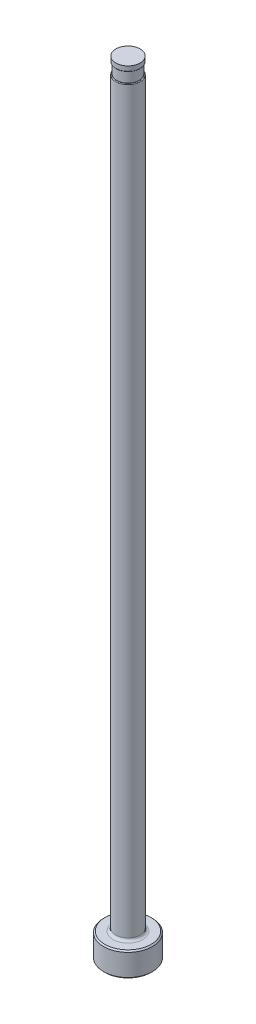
ISO-10303-21;
HEADER;
FILE_DESCRIPTION(('STEP AP214'),'2;1');
FILE_NAME('part.step','',(''),(''),'','','');
FILE_SCHEMA(('AUTOMOTIVE_DESIGN { 1 0 10303 214 1 1 1 1 }'));
ENDSEC;
DATA;
#1=APPLICATION_CONTEXT('core data for automotive mechanical design processes');
#2=APPLICATION_PROTOCOL_DEFINITION('international standard','automotive_design',2000,#1);
#3=PRODUCT_CONTEXT('',#1,'mechanical');
#4=PRODUCT('Part','Part','',(#3));
#5=PRODUCT_RELATED_PRODUCT_CATEGORY('part','',(#4));
#6=PRODUCT_DEFINITION_FORMATION('','',#4);
#7=PRODUCT_DEFINITION_CONTEXT('part definition',#1,'design');
#8=PRODUCT_DEFINITION('design','',#6,#7);
#9=PRODUCT_DEFINITION_SHAPE('','',#8);
#10=(LENGTH_UNIT() NAMED_UNIT(*) SI_UNIT(.MILLI.,.METRE.));
#11=(NAMED_UNIT(*) PLANE_ANGLE_UNIT() SI_UNIT($,.RADIAN.));
#12=(NAMED_UNIT(*) SI_UNIT($,.STERADIAN.) SOLID_ANGLE_UNIT());
#13=UNCERTAINTY_MEASURE_WITH_UNIT(LENGTH_MEASURE(1.E-05),#10,'distance_accuracy_value','');
#14=(GEOMETRIC_REPRESENTATION_CONTEXT(3) GLOBAL_UNCERTAINTY_ASSIGNED_CONTEXT((#13)) GLOBAL_UNIT_ASSIGNED_CONTEXT((#10,
#11,#12)) REPRESENTATION_CONTEXT('',''));
#15=CARTESIAN_POINT('',(0.,0.,0.));
#16=DIRECTION('',(0.,0.,1.));
#17=DIRECTION('',(1.,0.,0.));
#18=AXIS2_PLACEMENT_3D('',#15,#16,#17);
#19=CARTESIAN_POINT('',(-2.38124999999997,151.384,0.));
#20=DIRECTION('',(0.,1.,0.));
#21=DIRECTION('',(0.,0.,1.));
#22=AXIS2_PLACEMENT_3D('',#19,#20,#21);
#23=PLANE('',#22);
#24=CARTESIAN_POINT('',(0.,151.384,0.));
#25=DIRECTION('',(0.,1.,0.));
#26=DIRECTION('',(0.,0.,1.));
#27=AXIS2_PLACEMENT_3D('',#24,#25,#26);
#28=CIRCLE('',#27,2.24916999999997);
#29=CARTESIAN_POINT('',(0.,151.384,2.24916999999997));
#30=VERTEX_POINT('',#29);
#31=EDGE_CURVE('E11',#30,#30,#28,.F.);
#32=ORIENTED_EDGE('',*,*,#31,.T.);
#33=EDGE_LOOP('',(#32));
#34=FACE_BOUND('',#33,.T.);
#35=CARTESIAN_POINT('',(0.,151.384,0.));
#36=DIRECTION('',(0.,1.,0.));
#37=DIRECTION('',(0.,0.,1.));
#38=AXIS2_PLACEMENT_3D('',#35,#36,#37);
#39=CIRCLE('',#38,2.17804999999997);
#40=CARTESIAN_POINT('',(0.,151.384,2.17804999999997));
#41=VERTEX_POINT('',#40);
#42=EDGE_CURVE('E78',#41,#41,#39,.T.);
#43=ORIENTED_EDGE('',*,*,#42,.T.);
#44=EDGE_LOOP('',(#43));
#45=FACE_BOUND('',#44,.T.);
#46=ADVANCED_FACE('F36',(#34,#45),#23,.F.);
#47=CARTESIAN_POINT('',(0.,259.958771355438,0.));
#48=DIRECTION('',(0.,1.,0.));
#49=DIRECTION('',(0.,0.,1.));
#50=AXIS2_PLACEMENT_3D('',#47,#48,#49);
#51=CYLINDRICAL_SURFACE('',#50,2.38124999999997);
#52=DIRECTION('',(0.,1.,0.));
#53=VECTOR('',#52,1.);
#54=CARTESIAN_POINT('',(-2.17804999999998,259.958771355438,-0.962522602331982));
#55=LINE('',#54,#53);
#56=CARTESIAN_POINT('',(-2.17804999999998,149.225,-0.962522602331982));
#57=VERTEX_POINT('',#56);
#58=CARTESIAN_POINT('',(-2.17804999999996,86.868,-0.962522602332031));
#59=VERTEX_POINT('',#58);
#60=EDGE_CURVE('E73',#57,#59,#55,.F.);
#61=ORIENTED_EDGE('',*,*,#60,.F.);
#62=CARTESIAN_POINT('',(0.,149.225,0.));
#63=DIRECTION('',(0.,-1.,0.));
#64=DIRECTION('',(0.,0.,-1.));
#65=AXIS2_PLACEMENT_3D('',#62,#63,#64);
#66=CIRCLE('',#65,2.38124999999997);
#67=CARTESIAN_POINT('',(-2.17804999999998,149.225,0.962522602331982));
#68=VERTEX_POINT('',#67);
#69=EDGE_CURVE('E51',#57,#68,#66,.T.);
#70=ORIENTED_EDGE('',*,*,#69,.T.);
#71=DIRECTION('',(0.,1.,0.));
#72=VECTOR('',#71,1.);
#73=CARTESIAN_POINT('',(-2.17804999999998,259.958771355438,0.962522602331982));
#74=LINE('',#73,#72);
#75=CARTESIAN_POINT('',(-2.17804999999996,86.868,0.96252260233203));
#76=VERTEX_POINT('',#75);
#77=EDGE_CURVE('E84',#76,#68,#74,.T.);
#78=ORIENTED_EDGE('',*,*,#77,.F.);
#79=CARTESIAN_POINT('',(-2.17804999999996,86.868,-0.96252260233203));
#80=CARTESIAN_POINT('',(-2.17804780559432,86.8335018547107,-0.962518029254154));
#81=CARTESIAN_POINT('',(-2.17861298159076,86.799018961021,-0.96124991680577));
#82=CARTESIAN_POINT('',(-2.18085247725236,86.7302686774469,-0.956161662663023));
#83=CARTESIAN_POINT('',(-2.18252711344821,86.6960013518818,-0.952340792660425));
#84=CARTESIAN_POINT('',(-2.1891933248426,86.5935683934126,-0.936973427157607));
#85=CARTESIAN_POINT('',(-2.19582685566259,86.5260398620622,-0.921521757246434));
#86=CARTESIAN_POINT('',(-2.21282724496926,86.3946839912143,-0.879915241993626));
#87=CARTESIAN_POINT('',(-2.22320261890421,86.3308654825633,-0.853735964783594));
#88=CARTESIAN_POINT('',(-2.24648169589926,86.209467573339,-0.79044419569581));
#89=CARTESIAN_POINT('',(-2.25938069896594,86.1518768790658,-0.753351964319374));
#90=CARTESIAN_POINT('',(-2.28491232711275,86.0496356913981,-0.671716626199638));
#91=CARTESIAN_POINT('',(-2.29748627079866,86.0043240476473,-0.627987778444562));
#92=CARTESIAN_POINT('',(-2.32155764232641,85.9232931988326,-0.53211549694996));
#93=CARTESIAN_POINT('',(-2.33305607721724,85.8875649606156,-0.479980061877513));
#94=CARTESIAN_POINT('',(-2.35169958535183,85.8320195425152,-0.377071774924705));
#95=CARTESIAN_POINT('',(-2.35923505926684,85.8106414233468,-0.327210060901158));
#96=CARTESIAN_POINT('',(-2.37124673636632,85.7772228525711,-0.224104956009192));
#97=CARTESIAN_POINT('',(-2.37572523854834,85.7651753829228,-0.170864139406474));
#98=CARTESIAN_POINT('',(-2.38075337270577,85.7517017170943,-0.0686114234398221));
#99=CARTESIAN_POINT('',(-2.38166713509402,85.7492904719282,-0.01974474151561));
#100=CARTESIAN_POINT('',(-2.38048039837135,85.7524469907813,0.0776854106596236));
#101=CARTESIAN_POINT('',(-2.37838078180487,85.7580124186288,0.126248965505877));
#102=CARTESIAN_POINT('',(-2.37150634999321,85.7766178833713,0.220133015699));
#103=CARTESIAN_POINT('',(-2.36681675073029,85.7894201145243,0.265507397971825));
#104=CARTESIAN_POINT('',(-2.35529269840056,85.8218782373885,0.353434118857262));
#105=CARTESIAN_POINT('',(-2.34845810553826,85.8415345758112,0.395986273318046));
#106=CARTESIAN_POINT('',(-2.33302551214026,85.8878518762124,0.47872487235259));
#107=CARTESIAN_POINT('',(-2.32437464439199,85.9147318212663,0.518778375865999));
#108=CARTESIAN_POINT('',(-2.30627307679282,85.974276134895,0.594104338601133));
#109=CARTESIAN_POINT('',(-2.29682214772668,86.0069421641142,0.629375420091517));
#110=CARTESIAN_POINT('',(-2.2770553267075,86.080313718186,0.697674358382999));
#111=CARTESIAN_POINT('',(-2.26673904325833,86.1214804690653,0.730205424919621));
#112=CARTESIAN_POINT('',(-2.24701006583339,86.2083579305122,0.788832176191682));
#113=CARTESIAN_POINT('',(-2.23759789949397,86.2540712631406,0.81492411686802));
#114=CARTESIAN_POINT('',(-2.2192874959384,86.3550502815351,0.863643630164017));
#115=CARTESIAN_POINT('',(-2.21061480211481,86.410785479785,0.885381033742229));
#116=CARTESIAN_POINT('',(-2.1960946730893,86.5251026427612,0.92080773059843));
#117=CARTESIAN_POINT('',(-2.19024759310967,86.5836849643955,0.93449601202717));
#118=CARTESIAN_POINT('',(-2.18339215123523,86.6801545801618,0.950364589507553));
#119=CARTESIAN_POINT('',(-2.18139223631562,86.7176004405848,0.954933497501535));
#120=CARTESIAN_POINT('',(-2.17872026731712,86.7926947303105,0.961006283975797));
#121=CARTESIAN_POINT('',(-2.1780449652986,86.8303424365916,0.962517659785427));
#122=CARTESIAN_POINT('',(-2.17804999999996,86.868,0.96252260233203));
#123=B_SPLINE_CURVE_WITH_KNOTS('',3,(#79,#80,#81,#82,#83,#84,#85,#86,#87,#88,#89,#90,#91,#92,
#93,#94,#95,#96,#97,#98,#99,#100,#101,#102,#103,#104,#105,#106,#107,#108,#109,#110,#111,#112,
#113,#114,#115,#116,#117,#118,#119,#120,#121,#122),.UNSPECIFIED.,.F.,.F.,(4,2,2,2,2,2,2,2,2,2,2,
2,2,2,2,2,2,2,2,2,2,4),(0.,0.103435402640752,0.206900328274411,0.414624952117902,
0.622825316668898,0.830641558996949,1.02213180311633,1.21344091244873,1.37683606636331,
1.54010820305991,1.68618349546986,1.83221601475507,1.97370762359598,2.11520845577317,
2.26160909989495,2.40805183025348,2.56783060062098,2.72770205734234,2.90833881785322,
3.08899828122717,3.2021919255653,3.31510767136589),.UNSPECIFIED.);
#124=EDGE_CURVE('E81',#59,#76,#123,.T.);
#125=ORIENTED_EDGE('',*,*,#124,.F.);
#126=EDGE_LOOP('',(#61,#70,#78,#125));
#127=FACE_BOUND('',#126,.T.);
#128=CARTESIAN_POINT('',(0.,5.25779999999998,0.));
#129=DIRECTION('',(0.,1.,0.));
#130=DIRECTION('',(0.,0.,1.));
#131=AXIS2_PLACEMENT_3D('',#128,#129,#130);
#132=CIRCLE('',#131,2.38124999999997);
#133=CARTESIAN_POINT('',(0.,5.25779999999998,2.38124999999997));
#134=VERTEX_POINT('',#133);
#135=EDGE_CURVE('E116',#134,#134,#132,.T.);
#136=ORIENTED_EDGE('',*,*,#135,.T.);
#137=EDGE_LOOP('',(#136));
#138=FACE_BOUND('',#137,.T.);
#139=ADVANCED_FACE('F82',(#127,#138),#51,.T.);
#140=CARTESIAN_POINT('',(0.,0.,0.));
#141=DIRECTION('',(0.,-1.,0.));
#142=DIRECTION('',(0.,0.,-1.));
#143=AXIS2_PLACEMENT_3D('',#140,#141,#142);
#144=PLANE('',#143);
#145=CARTESIAN_POINT('',(0.,0.,0.));
#146=DIRECTION('',(0.,-1.,0.));
#147=DIRECTION('',(0.,0.,-1.));
#148=AXIS2_PLACEMENT_3D('',#145,#146,#147);
#149=CIRCLE('',#148,4.50849999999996);
#150=CARTESIAN_POINT('',(0.,0.,-4.50849999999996));
#151=VERTEX_POINT('',#150);
#152=EDGE_CURVE('E113',#151,#151,#149,.T.);
#153=ORIENTED_EDGE('',*,*,#152,.T.);
#154=EDGE_LOOP('',(#153));
#155=FACE_BOUND('',#154,.T.);
#156=ADVANCED_FACE('F192',(#155),#144,.T.);
#157=CARTESIAN_POINT('',(0.,259.958771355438,0.));
#158=DIRECTION('',(0.,1.,0.));
#159=DIRECTION('',(0.,0.,1.));
#160=AXIS2_PLACEMENT_3D('',#157,#158,#159);
#161=CYLINDRICAL_SURFACE('',#160,4.76249999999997);
#162=CARTESIAN_POINT('',(0.,4.49579999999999,0.));
#163=DIRECTION('',(0.,1.,0.));
#164=DIRECTION('',(0.,0.,1.));
#165=AXIS2_PLACEMENT_3D('',#162,#163,#164);
#166=CIRCLE('',#165,4.76249999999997);
#167=CARTESIAN_POINT('',(0.,4.49579999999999,4.76249999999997));
#168=VERTEX_POINT('',#167);
#169=EDGE_CURVE('E110',#168,#168,#166,.F.);
#170=ORIENTED_EDGE('',*,*,#169,.T.);
#171=EDGE_LOOP('',(#170));
#172=FACE_BOUND('',#171,.T.);
#173=CARTESIAN_POINT('',(0.,0.254000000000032,0.));
#174=DIRECTION('',(0.,-1.,0.));
#175=DIRECTION('',(0.,0.,-1.));
#176=AXIS2_PLACEMENT_3D('',#173,#174,#175);
#177=CIRCLE('',#176,4.76249999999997);
#178=CARTESIAN_POINT('',(0.,0.254000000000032,-4.76249999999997));
#179=VERTEX_POINT('',#178);
#180=EDGE_CURVE('E107',#179,#179,#177,.F.);
#181=ORIENTED_EDGE('',*,*,#180,.T.);
#182=EDGE_LOOP('',(#181));
#183=FACE_BOUND('',#182,.T.);
#184=ADVANCED_FACE('F195',(#172,#183),#161,.T.);
#185=CARTESIAN_POINT('',(-4.76249999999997,4.7498,0.));
#186=DIRECTION('',(0.,1.,0.));
#187=DIRECTION('',(0.,0.,1.));
#188=AXIS2_PLACEMENT_3D('',#185,#186,#187);
#189=PLANE('',#188);
#190=CARTESIAN_POINT('',(0.,4.7498,0.));
#191=DIRECTION('',(0.,1.,0.));
#192=DIRECTION('',(0.,0.,1.));
#193=AXIS2_PLACEMENT_3D('',#190,#191,#192);
#194=CIRCLE('',#193,2.88924999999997);
#195=CARTESIAN_POINT('',(0.,4.7498,2.88924999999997));
#196=VERTEX_POINT('',#195);
#197=EDGE_CURVE('E87',#196,#196,#194,.F.);
#198=ORIENTED_EDGE('',*,*,#197,.T.);
#199=EDGE_LOOP('',(#198));
#200=FACE_BOUND('',#199,.T.);
#201=CARTESIAN_POINT('',(0.,4.7498,0.));
#202=DIRECTION('',(0.,1.,0.));
#203=DIRECTION('',(0.,0.,1.));
#204=AXIS2_PLACEMENT_3D('',#201,#202,#203);
#205=CIRCLE('',#204,4.50849999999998);
#206=CARTESIAN_POINT('',(0.,4.7498,4.50849999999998));
#207=VERTEX_POINT('',#206);
#208=EDGE_CURVE('E104',#207,#207,#205,.T.);
#209=ORIENTED_EDGE('',*,*,#208,.T.);
#210=EDGE_LOOP('',(#209));
#211=FACE_BOUND('',#210,.T.);
#212=ADVANCED_FACE('F190',(#200,#211),#189,.T.);
#213=CARTESIAN_POINT('',(0.,4.74980000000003,0.));
#214=DIRECTION('',(0.,-1.,0.));
#215=DIRECTION('',(0.,0.,-1.));
#216=AXIS2_PLACEMENT_3D('',#213,#214,#215);
#217=CONICAL_SURFACE('',#216,4.50849999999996,0.785398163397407);
#218=ORIENTED_EDGE('',*,*,#169,.F.);
#219=EDGE_LOOP('',(#218));
#220=FACE_BOUND('',#219,.T.);
#221=ORIENTED_EDGE('',*,*,#208,.F.);
#222=EDGE_LOOP('',(#221));
#223=FACE_BOUND('',#222,.T.);
#224=ADVANCED_FACE('F186',(#220,#223),#217,.T.);
#225=CARTESIAN_POINT('',(0.,0.254000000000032,0.));
#226=DIRECTION('',(0.,1.,0.));
#227=DIRECTION('',(0.,0.,1.));
#228=AXIS2_PLACEMENT_3D('',#225,#226,#227);
#229=CONICAL_SURFACE('',#228,4.76249999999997,0.785398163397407);
#230=ORIENTED_EDGE('',*,*,#152,.F.);
#231=EDGE_LOOP('',(#230));
#232=FACE_BOUND('',#231,.T.);
#233=ORIENTED_EDGE('',*,*,#180,.F.);
#234=EDGE_LOOP('',(#233));
#235=FACE_BOUND('',#234,.T.);
#236=ADVANCED_FACE('F182',(#232,#235),#229,.T.);
#237=CARTESIAN_POINT('',(0.,5.25779999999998,0.));
#238=DIRECTION('',(0.,1.,0.));
#239=DIRECTION('',(0.,0.,1.));
#240=AXIS2_PLACEMENT_3D('',#237,#238,#239);
#241=TOROIDAL_SURFACE('',#240,2.88924999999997,0.508);
#242=ORIENTED_EDGE('',*,*,#197,.F.);
#243=EDGE_LOOP('',(#242));
#244=FACE_BOUND('',#243,.T.);
#245=ORIENTED_EDGE('',*,*,#135,.F.);
#246=EDGE_LOOP('',(#245));
#247=FACE_BOUND('',#246,.T.);
#248=ADVANCED_FACE('F147',(#244,#247),#241,.F.);
#249=CARTESIAN_POINT('',(-2.38124999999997,149.352,0.));
#250=DIRECTION('',(0.,-1.,0.));
#251=DIRECTION('',(0.,0.,-1.));
#252=AXIS2_PLACEMENT_3D('',#249,#250,#251);
#253=PLANE('',#252);
#254=DIRECTION('',(0.,0.,1.));
#255=VECTOR('',#254,1.);
#256=CARTESIAN_POINT('',(-2.17804999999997,149.352,0.));
#257=LINE('',#256,#255);
#258=CARTESIAN_POINT('',(-2.17804999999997,149.352,0.));
#259=VERTEX_POINT('',#258);
#260=CARTESIAN_POINT('',(-2.17804999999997,149.352,0.581155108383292));
#261=VERTEX_POINT('',#260);
#262=EDGE_CURVE('E90',#259,#261,#257,.T.);
#263=ORIENTED_EDGE('',*,*,#262,.T.);
#264=CARTESIAN_POINT('',(0.,149.352,0.));
#265=DIRECTION('',(0.,-1.,0.));
#266=DIRECTION('',(0.,0.,-1.));
#267=AXIS2_PLACEMENT_3D('',#264,#265,#266);
#268=CIRCLE('',#267,2.25424999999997);
#269=CARTESIAN_POINT('',(-2.17804999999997,149.352,-0.581155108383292));
#270=VERTEX_POINT('',#269);
#271=EDGE_CURVE('E86',#261,#270,#268,.F.);
#272=ORIENTED_EDGE('',*,*,#271,.T.);
#273=EDGE_CURVE('E79',#270,#259,#257,.T.);
#274=ORIENTED_EDGE('',*,*,#273,.T.);
#275=CARTESIAN_POINT('',(0.,149.352,0.));
#276=DIRECTION('',(0.,1.,0.));
#277=DIRECTION('',(0.,0.,1.));
#278=AXIS2_PLACEMENT_3D('',#275,#276,#277);
#279=CIRCLE('',#278,2.17804999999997);
#280=EDGE_CURVE('E101',#259,#259,#279,.T.);
#281=ORIENTED_EDGE('',*,*,#280,.F.);
#282=EDGE_LOOP('',(#263,#272,#274,#281));
#283=FACE_BOUND('',#282,.T.);
#284=ADVANCED_FACE('F144',(#283),#253,.F.);
#285=CARTESIAN_POINT('',(0.,153.448281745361,0.));
#286=DIRECTION('',(0.,1.,0.));
#287=DIRECTION('',(0.,0.,1.));
#288=AXIS2_PLACEMENT_3D('',#285,#286,#287);
#289=CYLINDRICAL_SURFACE('',#288,2.17804999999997);
#290=ORIENTED_EDGE('',*,*,#42,.F.);
#291=EDGE_LOOP('',(#290));
#292=FACE_BOUND('',#291,.T.);
#293=ORIENTED_EDGE('',*,*,#280,.T.);
#294=EDGE_LOOP('',(#293));
#295=FACE_BOUND('',#294,.T.);
#296=ADVANCED_FACE('F141',(#292,#295),#289,.T.);
#297=CARTESIAN_POINT('',(-2.17804999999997,150.368,-4.76249999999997));
#298=DIRECTION('',(1.,0.,0.));
#299=DIRECTION('',(0.,1.,0.));
#300=AXIS2_PLACEMENT_3D('',#297,#298,#299);
#301=PLANE('',#300);
#302=ORIENTED_EDGE('',*,*,#273,.F.);
#303=CARTESIAN_POINT('',(-2.17804999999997,149.352,-0.581155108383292));
#304=CARTESIAN_POINT('',(-2.17804999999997,149.351983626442,-0.602476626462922));
#305=CARTESIAN_POINT('',(-2.17804999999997,149.351640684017,-0.623812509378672));
#306=CARTESIAN_POINT('',(-2.17804999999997,149.349977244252,-0.666576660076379));
#307=CARTESIAN_POINT('',(-2.17804999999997,149.348650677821,-0.688004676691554));
#308=CARTESIAN_POINT('',(-2.17804999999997,149.344700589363,-0.730611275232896));
#309=CARTESIAN_POINT('',(-2.17804999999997,149.342085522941,-0.75179057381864));
#310=CARTESIAN_POINT('',(-2.17804999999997,149.335057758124,-0.793813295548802));
#311=CARTESIAN_POINT('',(-2.17804999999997,149.33064941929,-0.814657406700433));
#312=CARTESIAN_POINT('',(-2.17804999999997,149.320237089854,-0.851716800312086));
#313=CARTESIAN_POINT('',(-2.17804999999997,149.314702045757,-0.868052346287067));
#314=CARTESIAN_POINT('',(-2.17804999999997,149.303132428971,-0.894514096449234));
#315=CARTESIAN_POINT('',(-2.17804999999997,149.297824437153,-0.904954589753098));
#316=CARTESIAN_POINT('',(-2.17804999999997,149.285415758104,-0.924699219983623));
#317=CARTESIAN_POINT('',(-2.17804999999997,149.27833515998,-0.934014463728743));
#318=CARTESIAN_POINT('',(-2.17804999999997,149.267229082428,-0.944592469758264));
#319=CARTESIAN_POINT('',(-2.17804999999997,149.264360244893,-0.947051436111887));
#320=CARTESIAN_POINT('',(-2.17804999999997,149.258314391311,-0.951571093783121));
#321=CARTESIAN_POINT('',(-2.17804999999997,149.255137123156,-0.953631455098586));
#322=CARTESIAN_POINT('',(-2.17804999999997,149.248434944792,-0.957234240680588));
#323=CARTESIAN_POINT('',(-2.17804999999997,149.244905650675,-0.958768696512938));
#324=CARTESIAN_POINT('',(-2.17804999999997,149.237614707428,-0.961099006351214));
#325=CARTESIAN_POINT('',(-2.17804999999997,149.233854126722,-0.961898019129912));
#326=CARTESIAN_POINT('',(-2.17804999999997,149.229218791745,-0.962356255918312));
#327=CARTESIAN_POINT('',(-2.17804999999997,149.228376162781,-0.962418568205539));
#328=CARTESIAN_POINT('',(-2.17804999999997,149.226689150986,-0.962501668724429));
#329=CARTESIAN_POINT('',(-2.17804999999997,149.225844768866,-0.962522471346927));
#330=CARTESIAN_POINT('',(-2.17804999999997,149.225,-0.962522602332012));
#331=B_SPLINE_CURVE_WITH_KNOTS('',3,(#303,#304,#305,#306,#307,#308,#309,#310,#311,#312,#313,
#314,#315,#316,#317,#318,#319,#320,#321,#322,#323,#324,#325,#326,#327,#328,#329,#330),
.UNSPECIFIED.,.F.,.F.,(4,2,2,2,2,2,2,2,2,2,2,2,2,4),(0.,0.0639842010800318,0.128366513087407,
0.192331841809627,0.256142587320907,0.307700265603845,0.342760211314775,0.377439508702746,
0.38874898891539,0.400067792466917,0.411551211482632,0.422985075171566,0.425519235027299,
0.428052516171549),.UNSPECIFIED.);
#332=EDGE_CURVE('E59',#270,#57,#331,.T.);
#333=ORIENTED_EDGE('',*,*,#332,.T.);
#334=ORIENTED_EDGE('',*,*,#60,.T.);
#335=DIRECTION('',(0.,0.,1.));
#336=VECTOR('',#335,1.);
#337=CARTESIAN_POINT('',(-2.17804999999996,86.868,-4.76249999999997));
#338=LINE('',#337,#336);
#339=EDGE_CURVE('E77',#59,#76,#338,.T.);
#340=ORIENTED_EDGE('',*,*,#339,.T.);
#341=ORIENTED_EDGE('',*,*,#77,.T.);
#342=CARTESIAN_POINT('',(-2.17804999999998,149.225,0.962522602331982));
#343=CARTESIAN_POINT('',(-2.17804999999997,149.228186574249,0.962531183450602));
#344=CARTESIAN_POINT('',(-2.17804999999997,149.231361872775,0.9622263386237));
#345=CARTESIAN_POINT('',(-2.17804999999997,149.237573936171,0.961069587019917));
#346=CARTESIAN_POINT('',(-2.17804999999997,149.240611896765,0.960224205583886));
#347=CARTESIAN_POINT('',(-2.17804999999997,149.247208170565,0.957808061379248));
#348=CARTESIAN_POINT('',(-2.17804999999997,149.250720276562,0.956113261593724));
#349=CARTESIAN_POINT('',(-2.17804999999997,149.257436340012,0.952177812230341));
#350=CARTESIAN_POINT('',(-2.17804999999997,149.260638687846,0.949934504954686));
#351=CARTESIAN_POINT('',(-2.17804999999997,149.268556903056,0.943588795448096));
#352=CARTESIAN_POINT('',(-2.17804999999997,149.273024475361,0.93917980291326));
#353=CARTESIAN_POINT('',(-2.17804999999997,149.281265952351,0.929766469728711));
#354=CARTESIAN_POINT('',(-2.17804999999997,149.285038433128,0.924760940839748));
#355=CARTESIAN_POINT('',(-2.17804999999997,149.295602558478,0.909080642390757));
#356=CARTESIAN_POINT('',(-2.17804999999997,149.301541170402,0.897838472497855));
#357=CARTESIAN_POINT('',(-2.17804999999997,149.311910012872,0.87469166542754));
#358=CARTESIAN_POINT('',(-2.17804999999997,149.316335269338,0.862784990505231));
#359=CARTESIAN_POINT('',(-2.17804999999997,149.326383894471,0.831512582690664));
#360=CARTESIAN_POINT('',(-2.17804999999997,149.331178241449,0.811883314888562));
#361=CARTESIAN_POINT('',(-2.17804999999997,149.33896264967,0.772260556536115));
#362=CARTESIAN_POINT('',(-2.17804999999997,149.34194845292,0.752266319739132));
#363=CARTESIAN_POINT('',(-2.17804999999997,149.348978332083,0.691996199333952));
#364=CARTESIAN_POINT('',(-2.17804999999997,149.351079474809,0.651494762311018));
#365=CARTESIAN_POINT('',(-2.17804999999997,149.351838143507,0.606044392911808));
#366=CARTESIAN_POINT('',(-2.17804999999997,149.351899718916,0.601059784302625));
#367=CARTESIAN_POINT('',(-2.17804999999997,149.351980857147,0.591102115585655));
#368=CARTESIAN_POINT('',(-2.17804999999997,149.352000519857,0.586129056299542));
#369=CARTESIAN_POINT('',(-2.17804999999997,149.352,0.581155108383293));
#370=B_SPLINE_CURVE_WITH_KNOTS('',3,(#342,#343,#344,#345,#346,#347,#348,#349,#350,#351,#352,
#353,#354,#355,#356,#357,#358,#359,#360,#361,#362,#363,#364,#365,#366,#367,#368,#369),
.UNSPECIFIED.,.F.,.F.,(4,2,2,2,2,2,2,2,2,2,2,2,2,4),(0.,0.00952696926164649,0.0189410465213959,
0.0305748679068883,0.0422662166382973,0.060990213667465,0.0797521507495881,0.117682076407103,
0.155735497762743,0.216197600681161,0.27680150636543,0.39819894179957,0.413154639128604,
0.428074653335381),.UNSPECIFIED.);
#371=EDGE_CURVE('E172',#68,#261,#370,.T.);
#372=ORIENTED_EDGE('',*,*,#371,.T.);
#373=ORIENTED_EDGE('',*,*,#262,.F.);
#374=EDGE_LOOP('',(#302,#333,#334,#340,#341,#372,#373));
#375=FACE_BOUND('',#374,.T.);
#376=ADVANCED_FACE('F75',(#375),#301,.F.);
#377=CARTESIAN_POINT('',(-5.35304999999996,86.868,-4.76249999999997));
#378=DIRECTION('',(0.,0.,1.));
#379=DIRECTION('',(1.,0.,0.));
#380=AXIS2_PLACEMENT_3D('',#377,#378,#379);
#381=CYLINDRICAL_SURFACE('',#380,3.175);
#382=ORIENTED_EDGE('',*,*,#339,.F.);
#383=ORIENTED_EDGE('',*,*,#124,.T.);
#384=EDGE_LOOP('',(#382,#383));
#385=FACE_BOUND('',#384,.T.);
#386=ADVANCED_FACE('F89',(#385),#381,.F.);
#387=CARTESIAN_POINT('',(0.,152.687735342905,0.));
#388=DIRECTION('',(0.,1.,0.));
#389=DIRECTION('',(0.,0.,1.));
#390=AXIS2_PLACEMENT_3D('',#387,#388,#389);
#391=CYLINDRICAL_SURFACE('',#390,2.37616999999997);
#392=CARTESIAN_POINT('',(0.,151.511,0.));
#393=DIRECTION('',(0.,1.,0.));
#394=DIRECTION('',(0.,0.,1.));
#395=AXIS2_PLACEMENT_3D('',#392,#393,#394);
#396=CIRCLE('',#395,2.37616999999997);
#397=CARTESIAN_POINT('',(0.,151.511,2.37616999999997));
#398=VERTEX_POINT('',#397);
#399=EDGE_CURVE('E44',#398,#398,#396,.T.);
#400=ORIENTED_EDGE('',*,*,#399,.T.);
#401=EDGE_LOOP('',(#400));
#402=FACE_BOUND('',#401,.T.);
#403=CARTESIAN_POINT('',(0.,152.4,0.));
#404=DIRECTION('',(0.,1.,0.));
#405=DIRECTION('',(0.,0.,1.));
#406=AXIS2_PLACEMENT_3D('',#403,#404,#405);
#407=CIRCLE('',#406,2.37616999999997);
#408=CARTESIAN_POINT('',(0.,152.4,2.37616999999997));
#409=VERTEX_POINT('',#408);
#410=EDGE_CURVE('E91',#409,#409,#407,.T.);
#411=ORIENTED_EDGE('',*,*,#410,.F.);
#412=EDGE_LOOP('',(#411));
#413=FACE_BOUND('',#412,.T.);
#414=ADVANCED_FACE('F135',(#402,#413),#391,.T.);
#415=CARTESIAN_POINT('',(-2.38124999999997,152.4,0.));
#416=DIRECTION('',(0.,1.,0.));
#417=DIRECTION('',(0.,0.,1.));
#418=AXIS2_PLACEMENT_3D('',#415,#416,#417);
#419=PLANE('',#418);
#420=ORIENTED_EDGE('',*,*,#410,.T.);
#421=EDGE_LOOP('',(#420));
#422=FACE_BOUND('',#421,.T.);
#423=ADVANCED_FACE('F149',(#422),#419,.T.);
#424=CARTESIAN_POINT('',(0.,149.225,0.));
#425=DIRECTION('',(0.,-1.,0.));
#426=DIRECTION('',(0.,0.,-1.));
#427=AXIS2_PLACEMENT_3D('',#424,#425,#426);
#428=TOROIDAL_SURFACE('',#427,2.25424999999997,0.127);
#429=ORIENTED_EDGE('',*,*,#371,.F.);
#430=ORIENTED_EDGE('',*,*,#69,.F.);
#431=ORIENTED_EDGE('',*,*,#332,.F.);
#432=ORIENTED_EDGE('',*,*,#271,.F.);
#433=EDGE_LOOP('',(#429,#430,#431,#432));
#434=FACE_BOUND('',#433,.T.);
#435=ADVANCED_FACE('F151',(#434),#428,.T.);
#436=CARTESIAN_POINT('',(0.,151.511,0.));
#437=DIRECTION('',(0.,1.,0.));
#438=DIRECTION('',(0.,0.,1.));
#439=AXIS2_PLACEMENT_3D('',#436,#437,#438);
#440=TOROIDAL_SURFACE('',#439,2.24916999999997,0.127);
#441=ORIENTED_EDGE('',*,*,#31,.F.);
#442=EDGE_LOOP('',(#441));
#443=FACE_BOUND('',#442,.T.);
#444=ORIENTED_EDGE('',*,*,#399,.F.);
#445=EDGE_LOOP('',(#444));
#446=FACE_BOUND('',#445,.T.);
#447=ADVANCED_FACE('F38',(#443,#446),#440,.T.);
#448=CLOSED_SHELL('',(#46,#139,#156,#184,#212,#224,#236,#248,#284,#296,#376,#386,#414,#423,#435,#447));
#449=MANIFOLD_SOLID_BREP('B2',#448);
#450=ADVANCED_BREP_SHAPE_REPRESENTATION('',(#18,#449),#14);
#451=SHAPE_DEFINITION_REPRESENTATION(#9,#450);
ENDSEC;
END-ISO-10303-21;
